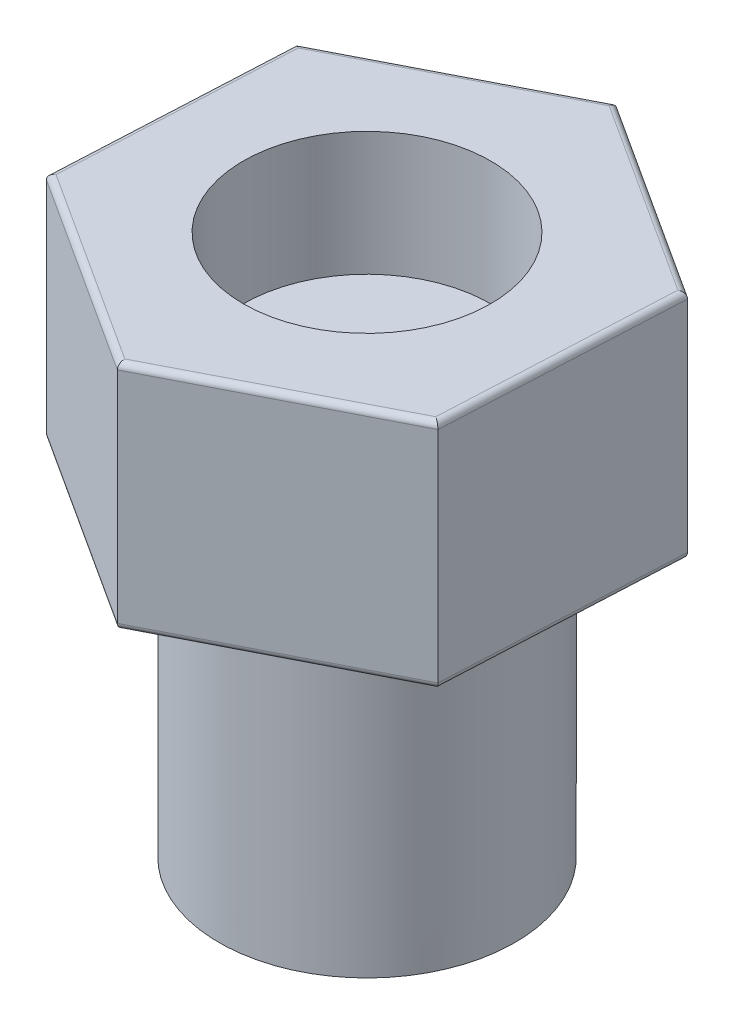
ISO-10303-21;
HEADER;
FILE_DESCRIPTION(('STEP AP214'),'2;1');
FILE_NAME('part.step','',(''),(''),'','','');
FILE_SCHEMA(('AUTOMOTIVE_DESIGN { 1 0 10303 214 1 1 1 1 }'));
ENDSEC;
DATA;
#1=APPLICATION_CONTEXT('core data for automotive mechanical design processes');
#2=APPLICATION_PROTOCOL_DEFINITION('international standard','automotive_design',2000,#1);
#3=PRODUCT_CONTEXT('',#1,'mechanical');
#4=PRODUCT('Part','Part','',(#3));
#5=PRODUCT_RELATED_PRODUCT_CATEGORY('part','',(#4));
#6=PRODUCT_DEFINITION_FORMATION('','',#4);
#7=PRODUCT_DEFINITION_CONTEXT('part definition',#1,'design');
#8=PRODUCT_DEFINITION('design','',#6,#7);
#9=PRODUCT_DEFINITION_SHAPE('','',#8);
#10=(LENGTH_UNIT() NAMED_UNIT(*) SI_UNIT(.MILLI.,.METRE.));
#11=(NAMED_UNIT(*) PLANE_ANGLE_UNIT() SI_UNIT($,.RADIAN.));
#12=(NAMED_UNIT(*) SI_UNIT($,.STERADIAN.) SOLID_ANGLE_UNIT());
#13=UNCERTAINTY_MEASURE_WITH_UNIT(LENGTH_MEASURE(1.E-05),#10,'distance_accuracy_value','');
#14=(GEOMETRIC_REPRESENTATION_CONTEXT(3) GLOBAL_UNCERTAINTY_ASSIGNED_CONTEXT((#13)) GLOBAL_UNIT_ASSIGNED_CONTEXT((#10,
#11,#12)) REPRESENTATION_CONTEXT('',''));
#15=CARTESIAN_POINT('',(0.,0.,0.));
#16=DIRECTION('',(0.,0.,1.));
#17=DIRECTION('',(1.,0.,0.));
#18=AXIS2_PLACEMENT_3D('',#15,#16,#17);
#19=CARTESIAN_POINT('',(12.320714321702,-2.22044604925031E-13,7.95319633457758));
#20=DIRECTION('',(0.,1.,0.));
#21=DIRECTION('',(0.,0.,1.));
#22=AXIS2_PLACEMENT_3D('',#19,#20,#21);
#23=PLANE('',#22);
#24=DIRECTION('',(-0.840161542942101,0.,-0.542336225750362));
#25=VECTOR('',#24,1.);
#26=CARTESIAN_POINT('',(19.0017542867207,-2.22044604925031E-13,-2.39675371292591));
#27=LINE('',#26,#25);
#28=CARTESIAN_POINT('',(0.705493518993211,-1.11022302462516E-13,-14.2072502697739));
#29=VERTEX_POINT('',#28);
#30=CARTESIAN_POINT('',(12.6565864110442,-1.11022302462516E-13,-6.49264982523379));
#31=VERTEX_POINT('',#30);
#32=EDGE_CURVE('E179',#29,#31,#27,.F.);
#33=ORIENTED_EDGE('',*,*,#32,.T.);
#34=DIRECTION('',(0.0495961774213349,0.,-0.998769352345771));
#35=VECTOR('',#34,1.);
#36=CARTESIAN_POINT('',(11.9401831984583,0.,7.93430019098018));
#37=LINE('',#36,#35);
#38=CARTESIAN_POINT('',(11.9510928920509,0.,7.71460044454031));
#39=VERTEX_POINT('',#38);
#40=EDGE_CURVE('E140',#31,#39,#37,.F.);
#41=ORIENTED_EDGE('',*,*,#40,.T.);
#42=DIRECTION('',(0.889757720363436,0.,-0.456433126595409));
#43=VECTOR('',#42,1.);
#44=CARTESIAN_POINT('',(12.1468133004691,1.11022302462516E-13,7.61419864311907));
#45=LINE('',#44,#43);
#46=CARTESIAN_POINT('',(-0.705493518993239,1.11022302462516E-13,14.2072502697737));
#47=VERTEX_POINT('',#46);
#48=EDGE_CURVE('E168',#39,#47,#45,.F.);
#49=ORIENTED_EDGE('',*,*,#48,.T.);
#50=DIRECTION('',(0.840161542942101,0.,0.542336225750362));
#51=VECTOR('',#50,1.);
#52=CARTESIAN_POINT('',(5.63967435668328,0.,18.3031463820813));
#53=LINE('',#52,#51);
#54=CARTESIAN_POINT('',(-12.6565864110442,1.11022302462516E-13,6.49264982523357));
#55=VERTEX_POINT('',#54);
#56=EDGE_CURVE('E173',#47,#55,#53,.F.);
#57=ORIENTED_EDGE('',*,*,#56,.T.);
#58=DIRECTION('',(-0.0495961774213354,0.,0.998769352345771));
#59=VECTOR('',#58,1.);
#60=CARTESIAN_POINT('',(-12.6674961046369,0.,6.71234957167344));
#61=LINE('',#60,#59);
#62=CARTESIAN_POINT('',(-11.951092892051,0.,-7.71460044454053));
#63=VERTEX_POINT('',#62);
#64=EDGE_CURVE('E175',#55,#63,#61,.F.);
#65=ORIENTED_EDGE('',*,*,#64,.T.);
#66=DIRECTION('',(-0.889757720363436,0.,0.45643312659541));
#67=VECTOR('',#66,1.);
#68=CARTESIAN_POINT('',(0.901213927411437,0.,-14.3076520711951));
#69=LINE('',#68,#67);
#70=EDGE_CURVE('E177',#63,#29,#69,.F.);
#71=ORIENTED_EDGE('',*,*,#70,.T.);
#72=EDGE_LOOP('',(#33,#41,#49,#57,#65,#71));
#73=FACE_BOUND('',#72,.T.);
#74=CARTESIAN_POINT('',(0.,0.,0.));
#75=DIRECTION('',(0.,1.,0.));
#76=DIRECTION('',(0.,0.,1.));
#77=AXIS2_PLACEMENT_3D('',#74,#75,#76);
#78=CIRCLE('',#77,9.1186);
#79=CARTESIAN_POINT('',(0.,0.,9.1186));
#80=VERTEX_POINT('',#79);
#81=EDGE_CURVE('E11',#80,#80,#78,.F.);
#82=ORIENTED_EDGE('',*,*,#81,.F.);
#83=EDGE_LOOP('',(#82));
#84=FACE_BOUND('',#83,.T.);
#85=ADVANCED_FACE('F39',(#73,#84),#23,.F.);
#86=CARTESIAN_POINT('',(-0.727312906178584,14.2747999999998,14.6466497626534));
#87=DIRECTION('',(-0.456433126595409,0.,-0.889757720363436));
#88=DIRECTION('',(-0.889757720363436,0.,0.456433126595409));
#89=AXIS2_PLACEMENT_3D('',#86,#87,#88);
#90=PLANE('',#89);
#91=DIRECTION('',(0.,-1.,0.));
#92=VECTOR('',#91,1.);
#93=CARTESIAN_POINT('',(-0.727312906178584,14.2747999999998,14.6466497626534));
#94=LINE('',#93,#92);
#95=CARTESIAN_POINT('',(-0.727312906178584,13.8938,14.6466497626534));
#96=VERTEX_POINT('',#95);
#97=CARTESIAN_POINT('',(-0.727312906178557,0.381000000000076,14.6466497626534));
#98=VERTEX_POINT('',#97);
#99=EDGE_CURVE('E225',#96,#98,#94,.T.);
#100=ORIENTED_EDGE('',*,*,#99,.T.);
#101=DIRECTION('',(0.889757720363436,0.,-0.456433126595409));
#102=VECTOR('',#101,1.);
#103=CARTESIAN_POINT('',(-0.727312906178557,0.381000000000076,14.6466497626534));
#104=LINE('',#103,#102);
#105=CARTESIAN_POINT('',(12.320714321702,0.381000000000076,7.95319633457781));
#106=VERTEX_POINT('',#105);
#107=EDGE_CURVE('E199',#98,#106,#104,.T.);
#108=ORIENTED_EDGE('',*,*,#107,.T.);
#109=DIRECTION('',(0.,-1.,0.));
#110=VECTOR('',#109,1.);
#111=CARTESIAN_POINT('',(12.320714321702,14.2747999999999,7.95319633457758));
#112=LINE('',#111,#110);
#113=CARTESIAN_POINT('',(12.320714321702,13.8938,7.95319633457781));
#114=VERTEX_POINT('',#113);
#115=EDGE_CURVE('E151',#114,#106,#112,.T.);
#116=ORIENTED_EDGE('',*,*,#115,.F.);
#117=DIRECTION('',(0.889757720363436,0.,-0.456433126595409));
#118=VECTOR('',#117,1.);
#119=CARTESIAN_POINT('',(-0.727312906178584,13.8938,14.6466497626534));
#120=LINE('',#119,#118);
#121=EDGE_CURVE('E197',#114,#96,#120,.F.);
#122=ORIENTED_EDGE('',*,*,#121,.T.);
#123=EDGE_LOOP('',(#100,#108,#116,#122));
#124=FACE_BOUND('',#123,.T.);
#125=ADVANCED_FACE('F251',(#124),#90,.F.);
#126=CARTESIAN_POINT('',(12.320714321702,14.2747999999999,7.95319633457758));
#127=DIRECTION('',(-0.998769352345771,0.,-0.0495961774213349));
#128=DIRECTION('',(-0.0495961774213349,0.,0.998769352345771));
#129=AXIS2_PLACEMENT_3D('',#126,#127,#128);
#130=PLANE('',#129);
#131=ORIENTED_EDGE('',*,*,#115,.T.);
#132=DIRECTION('',(0.0495961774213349,0.,-0.998769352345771));
#133=VECTOR('',#132,1.);
#134=CARTESIAN_POINT('',(12.320714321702,0.381000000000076,7.95319633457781));
#135=LINE('',#134,#133);
#136=CARTESIAN_POINT('',(13.0480272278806,0.380999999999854,-6.69345342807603));
#137=VERTEX_POINT('',#136);
#138=EDGE_CURVE('E150',#106,#137,#135,.T.);
#139=ORIENTED_EDGE('',*,*,#138,.T.);
#140=DIRECTION('',(0.,-1.,0.));
#141=VECTOR('',#140,1.);
#142=CARTESIAN_POINT('',(13.0480272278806,14.2748,-6.69345342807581));
#143=LINE('',#142,#141);
#144=CARTESIAN_POINT('',(13.0480272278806,13.8938,-6.69345342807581));
#145=VERTEX_POINT('',#144);
#146=EDGE_CURVE('E132',#145,#137,#143,.T.);
#147=ORIENTED_EDGE('',*,*,#146,.F.);
#148=DIRECTION('',(0.0495961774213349,0.,-0.998769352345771));
#149=VECTOR('',#148,1.);
#150=CARTESIAN_POINT('',(12.320714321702,13.8938,7.95319633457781));
#151=LINE('',#150,#149);
#152=EDGE_CURVE('E147',#145,#114,#151,.F.);
#153=ORIENTED_EDGE('',*,*,#152,.T.);
#154=EDGE_LOOP('',(#131,#139,#147,#153));
#155=FACE_BOUND('',#154,.T.);
#156=ADVANCED_FACE('F145',(#155),#130,.F.);
#157=CARTESIAN_POINT('',(13.0480272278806,14.2748,-6.69345342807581));
#158=DIRECTION('',(-0.542336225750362,0.,0.840161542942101));
#159=DIRECTION('',(0.840161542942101,0.,0.542336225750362));
#160=AXIS2_PLACEMENT_3D('',#157,#158,#159);
#161=PLANE('',#160);
#162=ORIENTED_EDGE('',*,*,#146,.T.);
#163=DIRECTION('',(-0.840161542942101,0.,-0.542336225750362));
#164=VECTOR('',#163,1.);
#165=CARTESIAN_POINT('',(13.0480272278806,0.380999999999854,-6.69345342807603));
#166=LINE('',#165,#164);
#167=CARTESIAN_POINT('',(0.727312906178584,0.381000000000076,-14.6466497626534));
#168=VERTEX_POINT('',#167);
#169=EDGE_CURVE('E139',#137,#168,#166,.T.);
#170=ORIENTED_EDGE('',*,*,#169,.T.);
#171=DIRECTION('',(0.,-1.,0.));
#172=VECTOR('',#171,1.);
#173=CARTESIAN_POINT('',(0.727312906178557,14.2747999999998,-14.6466497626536));
#174=LINE('',#173,#172);
#175=CARTESIAN_POINT('',(0.727312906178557,13.8938,-14.6466497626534));
#176=VERTEX_POINT('',#175);
#177=EDGE_CURVE('E134',#176,#168,#174,.T.);
#178=ORIENTED_EDGE('',*,*,#177,.F.);
#179=DIRECTION('',(-0.840161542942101,0.,-0.542336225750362));
#180=VECTOR('',#179,1.);
#181=CARTESIAN_POINT('',(13.0480272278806,13.8938,-6.69345342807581));
#182=LINE('',#181,#180);
#183=EDGE_CURVE('E129',#176,#145,#182,.F.);
#184=ORIENTED_EDGE('',*,*,#183,.T.);
#185=EDGE_LOOP('',(#162,#170,#178,#184));
#186=FACE_BOUND('',#185,.T.);
#187=ADVANCED_FACE('F131',(#186),#161,.F.);
#188=CARTESIAN_POINT('',(0.727312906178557,14.2747999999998,-14.6466497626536));
#189=DIRECTION('',(0.45643312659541,0.,0.889757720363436));
#190=DIRECTION('',(0.889757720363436,0.,-0.45643312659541));
#191=AXIS2_PLACEMENT_3D('',#188,#189,#190);
#192=PLANE('',#191);
#193=ORIENTED_EDGE('',*,*,#177,.T.);
#194=DIRECTION('',(-0.889757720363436,0.,0.45643312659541));
#195=VECTOR('',#194,1.);
#196=CARTESIAN_POINT('',(0.727312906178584,0.381000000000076,-14.6466497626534));
#197=LINE('',#196,#195);
#198=CARTESIAN_POINT('',(-12.320714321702,0.381000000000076,-7.95319633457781));
#199=VERTEX_POINT('',#198);
#200=EDGE_CURVE('E186',#168,#199,#197,.T.);
#201=ORIENTED_EDGE('',*,*,#200,.T.);
#202=DIRECTION('',(0.,-1.,0.));
#203=VECTOR('',#202,1.);
#204=CARTESIAN_POINT('',(-12.320714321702,14.2747999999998,-7.95319633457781));
#205=LINE('',#204,#203);
#206=CARTESIAN_POINT('',(-12.320714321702,13.8938,-7.95319633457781));
#207=VERTEX_POINT('',#206);
#208=EDGE_CURVE('E260',#207,#199,#205,.T.);
#209=ORIENTED_EDGE('',*,*,#208,.F.);
#210=DIRECTION('',(-0.889757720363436,0.,0.45643312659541));
#211=VECTOR('',#210,1.);
#212=CARTESIAN_POINT('',(0.727312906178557,13.8938,-14.6466497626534));
#213=LINE('',#212,#211);
#214=EDGE_CURVE('E184',#207,#176,#213,.F.);
#215=ORIENTED_EDGE('',*,*,#214,.T.);
#216=EDGE_LOOP('',(#193,#201,#209,#215));
#217=FACE_BOUND('',#216,.T.);
#218=ADVANCED_FACE('F269',(#217),#192,.F.);
#219=CARTESIAN_POINT('',(-12.320714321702,14.2747999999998,-7.95319633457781));
#220=DIRECTION('',(0.998769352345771,0.,0.0495961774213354));
#221=DIRECTION('',(0.0495961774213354,0.,-0.998769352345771));
#222=AXIS2_PLACEMENT_3D('',#219,#220,#221);
#223=PLANE('',#222);
#224=ORIENTED_EDGE('',*,*,#208,.T.);
#225=DIRECTION('',(-0.0495961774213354,0.,0.998769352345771));
#226=VECTOR('',#225,1.);
#227=CARTESIAN_POINT('',(-12.320714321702,0.381000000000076,-7.95319633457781));
#228=LINE('',#227,#226);
#229=CARTESIAN_POINT('',(-13.0480272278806,0.380999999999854,6.69345342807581));
#230=VERTEX_POINT('',#229);
#231=EDGE_CURVE('E190',#199,#230,#228,.T.);
#232=ORIENTED_EDGE('',*,*,#231,.T.);
#233=DIRECTION('',(0.,-1.,0.));
#234=VECTOR('',#233,1.);
#235=CARTESIAN_POINT('',(-13.0480272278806,14.2748,6.69345342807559));
#236=LINE('',#235,#234);
#237=CARTESIAN_POINT('',(-13.0480272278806,13.8938,6.69345342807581));
#238=VERTEX_POINT('',#237);
#239=EDGE_CURVE('E258',#238,#230,#236,.T.);
#240=ORIENTED_EDGE('',*,*,#239,.F.);
#241=DIRECTION('',(-0.0495961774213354,0.,0.998769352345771));
#242=VECTOR('',#241,1.);
#243=CARTESIAN_POINT('',(-12.320714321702,13.8938,-7.95319633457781));
#244=LINE('',#243,#242);
#245=EDGE_CURVE('E188',#238,#207,#244,.F.);
#246=ORIENTED_EDGE('',*,*,#245,.T.);
#247=EDGE_LOOP('',(#224,#232,#240,#246));
#248=FACE_BOUND('',#247,.T.);
#249=ADVANCED_FACE('F300',(#248),#223,.F.);
#250=CARTESIAN_POINT('',(-13.0480272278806,14.2748,6.69345342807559));
#251=DIRECTION('',(0.542336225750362,0.,-0.840161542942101));
#252=DIRECTION('',(-0.840161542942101,0.,-0.542336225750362));
#253=AXIS2_PLACEMENT_3D('',#250,#251,#252);
#254=PLANE('',#253);
#255=ORIENTED_EDGE('',*,*,#239,.T.);
#256=DIRECTION('',(0.840161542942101,0.,0.542336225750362));
#257=VECTOR('',#256,1.);
#258=CARTESIAN_POINT('',(-13.0480272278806,0.380999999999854,6.69345342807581));
#259=LINE('',#258,#257);
#260=EDGE_CURVE('E195',#230,#98,#259,.T.);
#261=ORIENTED_EDGE('',*,*,#260,.T.);
#262=ORIENTED_EDGE('',*,*,#99,.F.);
#263=DIRECTION('',(0.840161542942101,0.,0.542336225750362));
#264=VECTOR('',#263,1.);
#265=CARTESIAN_POINT('',(-13.0480272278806,13.8938,6.69345342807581));
#266=LINE('',#265,#264);
#267=EDGE_CURVE('E192',#96,#238,#266,.F.);
#268=ORIENTED_EDGE('',*,*,#267,.T.);
#269=EDGE_LOOP('',(#255,#261,#262,#268));
#270=FACE_BOUND('',#269,.T.);
#271=ADVANCED_FACE('F255',(#270),#254,.F.);
#272=CARTESIAN_POINT('',(12.320714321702,14.2747999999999,7.95319633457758));
#273=DIRECTION('',(0.,1.,0.));
#274=DIRECTION('',(0.,0.,1.));
#275=AXIS2_PLACEMENT_3D('',#272,#273,#274);
#276=PLANE('',#275);
#277=CARTESIAN_POINT('',(0.,14.2748,-2.22044604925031E-13));
#278=DIRECTION('',(0.,1.,0.));
#279=DIRECTION('',(0.,0.,1.));
#280=AXIS2_PLACEMENT_3D('',#277,#278,#279);
#281=CIRCLE('',#280,7.62);
#282=CARTESIAN_POINT('',(0.,14.2748,7.62));
#283=VERTEX_POINT('',#282);
#284=EDGE_CURVE('E348',#283,#283,#281,.T.);
#285=ORIENTED_EDGE('',*,*,#284,.F.);
#286=EDGE_LOOP('',(#285));
#287=FACE_BOUND('',#286,.T.);
#288=DIRECTION('',(-0.0495961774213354,0.,0.998769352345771));
#289=VECTOR('',#288,1.);
#290=CARTESIAN_POINT('',(-12.6674961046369,14.2747999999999,6.71234957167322));
#291=LINE('',#290,#289);
#292=CARTESIAN_POINT('',(-11.9510928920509,14.2748,-7.71460044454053));
#293=VERTEX_POINT('',#292);
#294=CARTESIAN_POINT('',(-12.6565864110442,14.2748000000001,6.49264982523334));
#295=VERTEX_POINT('',#294);
#296=EDGE_CURVE('E54',#293,#295,#291,.T.);
#297=ORIENTED_EDGE('',*,*,#296,.T.);
#298=DIRECTION('',(0.840161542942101,0.,0.542336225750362));
#299=VECTOR('',#298,1.);
#300=CARTESIAN_POINT('',(-0.520682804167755,14.2747999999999,14.3265482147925));
#301=LINE('',#300,#299);
#302=CARTESIAN_POINT('',(-0.705493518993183,14.2747999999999,14.2072502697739));
#303=VERTEX_POINT('',#302);
#304=EDGE_CURVE('E47',#295,#303,#301,.T.);
#305=ORIENTED_EDGE('',*,*,#304,.T.);
#306=DIRECTION('',(0.889757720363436,0.,-0.456433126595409));
#307=VECTOR('',#306,1.);
#308=CARTESIAN_POINT('',(12.1468133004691,14.2748000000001,7.61419864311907));
#309=LINE('',#308,#307);
#310=CARTESIAN_POINT('',(11.9510928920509,14.2748,7.71460044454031));
#311=VERTEX_POINT('',#310);
#312=EDGE_CURVE('E201',#303,#311,#309,.T.);
#313=ORIENTED_EDGE('',*,*,#312,.T.);
#314=DIRECTION('',(0.0495961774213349,0.,-0.998769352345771));
#315=VECTOR('',#314,1.);
#316=CARTESIAN_POINT('',(12.6674961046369,14.2747999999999,-6.71234957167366));
#317=LINE('',#316,#315);
#318=CARTESIAN_POINT('',(12.6565864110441,14.2747999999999,-6.49264982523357));
#319=VERTEX_POINT('',#318);
#320=EDGE_CURVE('E203',#311,#319,#317,.T.);
#321=ORIENTED_EDGE('',*,*,#320,.T.);
#322=DIRECTION('',(-0.840161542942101,0.,-0.542336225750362));
#323=VECTOR('',#322,1.);
#324=CARTESIAN_POINT('',(0.520682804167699,14.2747999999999,-14.3265482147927));
#325=LINE('',#324,#323);
#326=CARTESIAN_POINT('',(0.705493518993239,14.2747999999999,-14.2072502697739));
#327=VERTEX_POINT('',#326);
#328=EDGE_CURVE('E156',#319,#327,#325,.T.);
#329=ORIENTED_EDGE('',*,*,#328,.T.);
#330=DIRECTION('',(-0.889757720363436,0.,0.45643312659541));
#331=VECTOR('',#330,1.);
#332=CARTESIAN_POINT('',(-12.1468133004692,14.2747999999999,-7.6141986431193));
#333=LINE('',#332,#331);
#334=EDGE_CURVE('E59',#327,#293,#333,.T.);
#335=ORIENTED_EDGE('',*,*,#334,.T.);
#336=EDGE_LOOP('',(#297,#305,#313,#321,#329,#335));
#337=FACE_BOUND('',#336,.T.);
#338=ADVANCED_FACE('F245',(#287,#337),#276,.T.);
#339=CARTESIAN_POINT('',(-11.9401831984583,0.381000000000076,-7.9343001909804));
#340=DIRECTION('',(-0.0495961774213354,0.,0.998769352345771));
#341=DIRECTION('',(0.998769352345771,0.,0.0495961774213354));
#342=AXIS2_PLACEMENT_3D('',#339,#340,#341);
#343=CYLINDRICAL_SURFACE('',#342,0.381);
#344=CARTESIAN_POINT('',(-11.951092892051,0.380999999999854,-7.71460044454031));
#345=DIRECTION('',(-0.542336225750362,0.,0.840161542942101));
#346=DIRECTION('',(0.840161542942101,0.,0.542336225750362));
#347=AXIS2_PLACEMENT_3D('',#344,#345,#346);
#348=ELLIPSE('',#347,0.439940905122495,0.381);
#349=EDGE_CURVE('E219',#63,#199,#348,.F.);
#350=ORIENTED_EDGE('',*,*,#349,.F.);
#351=ORIENTED_EDGE('',*,*,#64,.F.);
#352=CARTESIAN_POINT('',(-12.6565864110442,0.380999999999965,6.49264982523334));
#353=DIRECTION('',(0.456433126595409,0.,0.889757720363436));
#354=DIRECTION('',(0.889757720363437,0.,-0.456433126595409));
#355=AXIS2_PLACEMENT_3D('',#352,#353,#354);
#356=ELLIPSE('',#355,0.439940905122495,0.381);
#357=EDGE_CURVE('E222',#230,#55,#356,.T.);
#358=ORIENTED_EDGE('',*,*,#357,.F.);
#359=ORIENTED_EDGE('',*,*,#231,.F.);
#360=EDGE_LOOP('',(#350,#351,#358,#359));
#361=FACE_BOUND('',#360,.T.);
#362=ADVANCED_FACE('F298',(#361),#343,.T.);
#363=CARTESIAN_POINT('',(-12.8413971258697,0.380999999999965,6.37335188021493));
#364=DIRECTION('',(0.840161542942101,0.,0.542336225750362));
#365=DIRECTION('',(0.542336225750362,0.,-0.840161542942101));
#366=AXIS2_PLACEMENT_3D('',#363,#364,#365);
#367=CYLINDRICAL_SURFACE('',#366,0.381);
#368=ORIENTED_EDGE('',*,*,#357,.T.);
#369=ORIENTED_EDGE('',*,*,#56,.F.);
#370=CARTESIAN_POINT('',(-0.705493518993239,0.380999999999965,14.2072502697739));
#371=DIRECTION('',(0.998769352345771,0.,0.0495961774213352));
#372=DIRECTION('',(0.049596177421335,0.,-0.998769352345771));
#373=AXIS2_PLACEMENT_3D('',#370,#371,#372);
#374=ELLIPSE('',#373,0.439940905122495,0.381);
#375=EDGE_CURVE('E216',#98,#47,#374,.T.);
#376=ORIENTED_EDGE('',*,*,#375,.F.);
#377=ORIENTED_EDGE('',*,*,#260,.F.);
#378=EDGE_LOOP('',(#368,#369,#376,#377));
#379=FACE_BOUND('',#378,.T.);
#380=ADVANCED_FACE('F294',(#379),#367,.T.);
#381=CARTESIAN_POINT('',(0.901213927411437,0.380999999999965,-14.3076520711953));
#382=DIRECTION('',(-0.889757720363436,0.,0.45643312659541));
#383=DIRECTION('',(0.45643312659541,0.,0.889757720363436));
#384=AXIS2_PLACEMENT_3D('',#381,#382,#383);
#385=CYLINDRICAL_SURFACE('',#384,0.381);
#386=ORIENTED_EDGE('',*,*,#349,.T.);
#387=ORIENTED_EDGE('',*,*,#200,.F.);
#388=CARTESIAN_POINT('',(0.705493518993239,0.380999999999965,-14.2072502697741));
#389=DIRECTION('',(-0.998769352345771,0.,-0.0495961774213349));
#390=DIRECTION('',(-0.0495961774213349,0.,0.998769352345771));
#391=AXIS2_PLACEMENT_3D('',#388,#389,#390);
#392=ELLIPSE('',#391,0.439940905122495,0.381);
#393=EDGE_CURVE('E213',#29,#168,#392,.F.);
#394=ORIENTED_EDGE('',*,*,#393,.F.);
#395=ORIENTED_EDGE('',*,*,#70,.F.);
#396=EDGE_LOOP('',(#386,#387,#394,#395));
#397=FACE_BOUND('',#396,.T.);
#398=ADVANCED_FACE('F273',(#397),#385,.T.);
#399=CARTESIAN_POINT('',(-0.901213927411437,0.380999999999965,14.3076520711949));
#400=DIRECTION('',(0.889757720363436,0.,-0.456433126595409));
#401=DIRECTION('',(-0.456433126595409,0.,-0.889757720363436));
#402=AXIS2_PLACEMENT_3D('',#399,#400,#401);
#403=CYLINDRICAL_SURFACE('',#402,0.381);
#404=ORIENTED_EDGE('',*,*,#375,.T.);
#405=ORIENTED_EDGE('',*,*,#48,.F.);
#406=CARTESIAN_POINT('',(11.9510928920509,0.380999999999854,7.71460044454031));
#407=DIRECTION('',(0.542336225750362,0.,-0.840161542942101));
#408=DIRECTION('',(0.840161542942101,0.,0.542336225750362));
#409=AXIS2_PLACEMENT_3D('',#406,#407,#408);
#410=ELLIPSE('',#409,0.439940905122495,0.381);
#411=EDGE_CURVE('E211',#106,#39,#410,.T.);
#412=ORIENTED_EDGE('',*,*,#411,.F.);
#413=ORIENTED_EDGE('',*,*,#107,.F.);
#414=EDGE_LOOP('',(#404,#405,#412,#413));
#415=FACE_BOUND('',#414,.T.);
#416=ADVANCED_FACE('F290',(#415),#403,.T.);
#417=CARTESIAN_POINT('',(12.8413971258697,0.380999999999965,-6.37335188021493));
#418=DIRECTION('',(-0.840161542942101,0.,-0.542336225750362));
#419=DIRECTION('',(-0.542336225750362,0.,0.840161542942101));
#420=AXIS2_PLACEMENT_3D('',#417,#418,#419);
#421=CYLINDRICAL_SURFACE('',#420,0.381);
#422=ORIENTED_EDGE('',*,*,#393,.T.);
#423=ORIENTED_EDGE('',*,*,#169,.F.);
#424=CARTESIAN_POINT('',(12.6565864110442,0.380999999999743,-6.49264982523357));
#425=DIRECTION('',(-0.456433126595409,0.,-0.889757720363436));
#426=DIRECTION('',(-0.889757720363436,0.,0.45643312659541));
#427=AXIS2_PLACEMENT_3D('',#424,#425,#426);
#428=ELLIPSE('',#427,0.439940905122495,0.381);
#429=EDGE_CURVE('E209',#31,#137,#428,.F.);
#430=ORIENTED_EDGE('',*,*,#429,.F.);
#431=ORIENTED_EDGE('',*,*,#32,.F.);
#432=EDGE_LOOP('',(#422,#423,#430,#431));
#433=FACE_BOUND('',#432,.T.);
#434=ADVANCED_FACE('F279',(#433),#421,.T.);
#435=CARTESIAN_POINT('',(11.9401831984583,0.381000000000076,7.93430019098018));
#436=DIRECTION('',(0.0495961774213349,0.,-0.998769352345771));
#437=DIRECTION('',(-0.998769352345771,0.,-0.0495961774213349));
#438=AXIS2_PLACEMENT_3D('',#435,#436,#437);
#439=CYLINDRICAL_SURFACE('',#438,0.381);
#440=ORIENTED_EDGE('',*,*,#411,.T.);
#441=ORIENTED_EDGE('',*,*,#40,.F.);
#442=ORIENTED_EDGE('',*,*,#429,.T.);
#443=ORIENTED_EDGE('',*,*,#138,.F.);
#444=EDGE_LOOP('',(#440,#441,#442,#443));
#445=FACE_BOUND('',#444,.T.);
#446=ADVANCED_FACE('F285',(#445),#439,.T.);
#447=CARTESIAN_POINT('',(19.0017542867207,13.8938,-2.39675371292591));
#448=DIRECTION('',(0.840161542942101,0.,0.542336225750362));
#449=DIRECTION('',(0.542336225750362,0.,-0.840161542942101));
#450=AXIS2_PLACEMENT_3D('',#447,#448,#449);
#451=CYLINDRICAL_SURFACE('',#450,0.381);
#452=CARTESIAN_POINT('',(12.6565864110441,13.8937999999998,-6.49264982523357));
#453=DIRECTION('',(0.456433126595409,0.,0.889757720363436));
#454=DIRECTION('',(-0.889757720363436,0.,0.45643312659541));
#455=AXIS2_PLACEMENT_3D('',#452,#453,#454);
#456=ELLIPSE('',#455,0.439940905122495,0.381);
#457=EDGE_CURVE('E155',#145,#319,#456,.T.);
#458=ORIENTED_EDGE('',*,*,#457,.F.);
#459=ORIENTED_EDGE('',*,*,#183,.F.);
#460=CARTESIAN_POINT('',(0.705493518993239,13.8937999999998,-14.2072502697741));
#461=DIRECTION('',(0.998769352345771,0.,0.0495961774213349));
#462=DIRECTION('',(-0.0495961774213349,0.,0.998769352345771));
#463=AXIS2_PLACEMENT_3D('',#460,#461,#462);
#464=ELLIPSE('',#463,0.439940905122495,0.381);
#465=EDGE_CURVE('E159',#327,#176,#464,.F.);
#466=ORIENTED_EDGE('',*,*,#465,.F.);
#467=ORIENTED_EDGE('',*,*,#328,.F.);
#468=EDGE_LOOP('',(#458,#459,#466,#467));
#469=FACE_BOUND('',#468,.T.);
#470=ADVANCED_FACE('F41',(#469),#451,.T.);
#471=CARTESIAN_POINT('',(0.901213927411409,13.8938,-14.3076520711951));
#472=DIRECTION('',(0.889757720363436,0.,-0.45643312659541));
#473=DIRECTION('',(-0.45643312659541,0.,-0.889757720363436));
#474=AXIS2_PLACEMENT_3D('',#471,#472,#473);
#475=CYLINDRICAL_SURFACE('',#474,0.381);
#476=ORIENTED_EDGE('',*,*,#465,.T.);
#477=ORIENTED_EDGE('',*,*,#214,.F.);
#478=CARTESIAN_POINT('',(-11.9510928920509,13.8938,-7.71460044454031));
#479=DIRECTION('',(0.542336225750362,0.,-0.840161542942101));
#480=DIRECTION('',(0.840161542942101,0.,0.542336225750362));
#481=AXIS2_PLACEMENT_3D('',#478,#479,#480);
#482=ELLIPSE('',#481,0.439940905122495,0.381);
#483=EDGE_CURVE('E160',#293,#207,#482,.F.);
#484=ORIENTED_EDGE('',*,*,#483,.F.);
#485=ORIENTED_EDGE('',*,*,#334,.F.);
#486=EDGE_LOOP('',(#476,#477,#484,#485));
#487=FACE_BOUND('',#486,.T.);
#488=ADVANCED_FACE('F235',(#487),#475,.T.);
#489=CARTESIAN_POINT('',(11.9401831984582,13.8938,7.93430019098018));
#490=DIRECTION('',(-0.0495961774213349,0.,0.998769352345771));
#491=DIRECTION('',(0.998769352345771,0.,0.0495961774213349));
#492=AXIS2_PLACEMENT_3D('',#489,#490,#491);
#493=CYLINDRICAL_SURFACE('',#492,0.381);
#494=ORIENTED_EDGE('',*,*,#457,.T.);
#495=ORIENTED_EDGE('',*,*,#320,.F.);
#496=CARTESIAN_POINT('',(11.9510928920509,13.8937999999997,7.71460044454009));
#497=DIRECTION('',(-0.542336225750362,0.,0.840161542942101));
#498=DIRECTION('',(-0.840161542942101,0.,-0.542336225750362));
#499=AXIS2_PLACEMENT_3D('',#496,#497,#498);
#500=ELLIPSE('',#499,0.439940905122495,0.381);
#501=EDGE_CURVE('E165',#114,#311,#500,.T.);
#502=ORIENTED_EDGE('',*,*,#501,.F.);
#503=ORIENTED_EDGE('',*,*,#152,.F.);
#504=EDGE_LOOP('',(#494,#495,#502,#503));
#505=FACE_BOUND('',#504,.T.);
#506=ADVANCED_FACE('F163',(#505),#493,.T.);
#507=CARTESIAN_POINT('',(-12.6674961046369,13.8937999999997,6.71234957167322));
#508=DIRECTION('',(0.0495961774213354,0.,-0.998769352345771));
#509=DIRECTION('',(-0.998769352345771,0.,-0.0495961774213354));
#510=AXIS2_PLACEMENT_3D('',#507,#508,#509);
#511=CYLINDRICAL_SURFACE('',#510,0.381);
#512=ORIENTED_EDGE('',*,*,#483,.T.);
#513=ORIENTED_EDGE('',*,*,#245,.F.);
#514=CARTESIAN_POINT('',(-12.6565864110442,13.8937999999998,6.49264982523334));
#515=DIRECTION('',(-0.456433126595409,0.,-0.889757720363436));
#516=DIRECTION('',(0.889757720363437,0.,-0.456433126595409));
#517=AXIS2_PLACEMENT_3D('',#514,#515,#516);
#518=ELLIPSE('',#517,0.439940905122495,0.381);
#519=EDGE_CURVE('E228',#295,#238,#518,.F.);
#520=ORIENTED_EDGE('',*,*,#519,.F.);
#521=ORIENTED_EDGE('',*,*,#296,.F.);
#522=EDGE_LOOP('',(#512,#513,#520,#521));
#523=FACE_BOUND('',#522,.T.);
#524=ADVANCED_FACE('F238',(#523),#511,.T.);
#525=CARTESIAN_POINT('',(12.1468133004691,13.8937999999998,7.61419864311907));
#526=DIRECTION('',(-0.889757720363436,0.,0.456433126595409));
#527=DIRECTION('',(0.456433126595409,0.,0.889757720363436));
#528=AXIS2_PLACEMENT_3D('',#525,#526,#527);
#529=CYLINDRICAL_SURFACE('',#528,0.381);
#530=ORIENTED_EDGE('',*,*,#501,.T.);
#531=ORIENTED_EDGE('',*,*,#312,.F.);
#532=CARTESIAN_POINT('',(-0.705493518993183,13.8937999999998,14.2072502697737));
#533=DIRECTION('',(-0.998769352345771,0.,-0.0495961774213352));
#534=DIRECTION('',(-0.049596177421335,0.,0.998769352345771));
#535=AXIS2_PLACEMENT_3D('',#532,#533,#534);
#536=ELLIPSE('',#535,0.439940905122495,0.381);
#537=EDGE_CURVE('E226',#96,#303,#536,.T.);
#538=ORIENTED_EDGE('',*,*,#537,.F.);
#539=ORIENTED_EDGE('',*,*,#121,.F.);
#540=EDGE_LOOP('',(#530,#531,#538,#539));
#541=FACE_BOUND('',#540,.T.);
#542=ADVANCED_FACE('F247',(#541),#529,.T.);
#543=CARTESIAN_POINT('',(5.63967435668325,13.8938,18.3031463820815));
#544=DIRECTION('',(-0.840161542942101,0.,-0.542336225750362));
#545=DIRECTION('',(-0.542336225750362,0.,0.840161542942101));
#546=AXIS2_PLACEMENT_3D('',#543,#544,#545);
#547=CYLINDRICAL_SURFACE('',#546,0.381);
#548=ORIENTED_EDGE('',*,*,#519,.T.);
#549=ORIENTED_EDGE('',*,*,#267,.F.);
#550=ORIENTED_EDGE('',*,*,#537,.T.);
#551=ORIENTED_EDGE('',*,*,#304,.F.);
#552=EDGE_LOOP('',(#548,#549,#550,#551));
#553=FACE_BOUND('',#552,.T.);
#554=ADVANCED_FACE('F242',(#553),#547,.T.);
#555=CARTESIAN_POINT('',(0.,0.,0.));
#556=DIRECTION('',(0.,1.,0.));
#557=DIRECTION('',(0.,0.,-1.));
#558=AXIS2_PLACEMENT_3D('',#555,#556,#557);
#559=CONICAL_SURFACE('',#558,9.1186,0.000349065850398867);
#560=CARTESIAN_POINT('',(0.,-19.0500000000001,-2.22044604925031E-13));
#561=DIRECTION('',(0.,-1.,0.));
#562=DIRECTION('',(0.,0.,-1.));
#563=AXIS2_PLACEMENT_3D('',#560,#561,#562);
#564=CIRCLE('',#563,9.11195029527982);
#565=CARTESIAN_POINT('',(0.,-19.0500000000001,-9.11195029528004));
#566=VERTEX_POINT('',#565);
#567=EDGE_CURVE('E229',#566,#566,#564,.T.);
#568=ORIENTED_EDGE('',*,*,#567,.F.);
#569=EDGE_LOOP('',(#568));
#570=FACE_BOUND('',#569,.T.);
#571=ORIENTED_EDGE('',*,*,#81,.T.);
#572=EDGE_LOOP('',(#571));
#573=FACE_BOUND('',#572,.T.);
#574=ADVANCED_FACE('F319',(#570,#573),#559,.T.);
#575=CARTESIAN_POINT('',(0.,-19.0500000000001,-2.22044604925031E-13));
#576=DIRECTION('',(0.,-1.,0.));
#577=DIRECTION('',(0.,0.,-1.));
#578=AXIS2_PLACEMENT_3D('',#575,#576,#577);
#579=PLANE('',#578);
#580=CARTESIAN_POINT('',(0.,-19.0500000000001,-2.22044604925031E-13));
#581=DIRECTION('',(0.,-1.,0.));
#582=DIRECTION('',(0.,0.,-1.));
#583=AXIS2_PLACEMENT_3D('',#580,#581,#582);
#584=CIRCLE('',#583,6.35);
#585=CARTESIAN_POINT('',(0.,-19.0500000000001,-6.35000000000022));
#586=VERTEX_POINT('',#585);
#587=EDGE_CURVE('E347',#586,#586,#584,.T.);
#588=ORIENTED_EDGE('',*,*,#587,.F.);
#589=EDGE_LOOP('',(#588));
#590=FACE_BOUND('',#589,.T.);
#591=ORIENTED_EDGE('',*,*,#567,.T.);
#592=EDGE_LOOP('',(#591));
#593=FACE_BOUND('',#592,.T.);
#594=ADVANCED_FACE('F322',(#590,#593),#579,.T.);
#595=CARTESIAN_POINT('',(0.,1.26999999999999,0.));
#596=DIRECTION('',(0.,-1.,0.));
#597=DIRECTION('',(0.,0.,-1.));
#598=AXIS2_PLACEMENT_3D('',#595,#596,#597);
#599=CYLINDRICAL_SURFACE('',#598,6.35);
#600=CARTESIAN_POINT('',(0.,1.26999999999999,0.));
#601=DIRECTION('',(0.,-1.,0.));
#602=DIRECTION('',(0.,0.,-1.));
#603=AXIS2_PLACEMENT_3D('',#600,#601,#602);
#604=CIRCLE('',#603,6.35);
#605=CARTESIAN_POINT('',(0.,1.26999999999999,-6.35));
#606=VERTEX_POINT('',#605);
#607=EDGE_CURVE('E351',#606,#606,#604,.T.);
#608=ORIENTED_EDGE('',*,*,#607,.F.);
#609=EDGE_LOOP('',(#608));
#610=FACE_BOUND('',#609,.T.);
#611=ORIENTED_EDGE('',*,*,#587,.T.);
#612=EDGE_LOOP('',(#611));
#613=FACE_BOUND('',#612,.T.);
#614=ADVANCED_FACE('F326',(#610,#613),#599,.F.);
#615=CARTESIAN_POINT('',(0.,1.26999999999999,0.));
#616=DIRECTION('',(0.,-1.,0.));
#617=DIRECTION('',(0.,0.,-1.));
#618=AXIS2_PLACEMENT_3D('',#615,#616,#617);
#619=PLANE('',#618);
#620=ORIENTED_EDGE('',*,*,#607,.T.);
#621=EDGE_LOOP('',(#620));
#622=FACE_BOUND('',#621,.T.);
#623=ADVANCED_FACE('F330',(#622),#619,.T.);
#624=CARTESIAN_POINT('',(0.,6.65479999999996,0.));
#625=DIRECTION('',(0.,1.,0.));
#626=DIRECTION('',(0.,0.,1.));
#627=AXIS2_PLACEMENT_3D('',#624,#625,#626);
#628=CYLINDRICAL_SURFACE('',#627,7.62);
#629=CARTESIAN_POINT('',(0.,6.65479999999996,0.));
#630=DIRECTION('',(0.,1.,0.));
#631=DIRECTION('',(0.,0.,1.));
#632=AXIS2_PLACEMENT_3D('',#629,#630,#631);
#633=CIRCLE('',#632,7.62);
#634=CARTESIAN_POINT('',(0.,6.65479999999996,7.62));
#635=VERTEX_POINT('',#634);
#636=EDGE_CURVE('E346',#635,#635,#633,.T.);
#637=CARTESIAN_POINT('',(0.,6.65479999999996,7.62));
#638=CARTESIAN_POINT('',(0.,6.73417499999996,7.62));
#639=CARTESIAN_POINT('',(0.,6.81354999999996,7.62));
#640=CARTESIAN_POINT('',(0.,6.97229999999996,7.62));
#641=CARTESIAN_POINT('',(0.,7.05167499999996,7.62));
#642=CARTESIAN_POINT('',(0.,7.21042499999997,7.62));
#643=CARTESIAN_POINT('',(0.,7.28979999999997,7.62));
#644=CARTESIAN_POINT('',(0.,7.44854999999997,7.62));
#645=CARTESIAN_POINT('',(0.,7.52792499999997,7.62));
#646=CARTESIAN_POINT('',(0.,7.68667499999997,7.62));
#647=CARTESIAN_POINT('',(0.,7.76604999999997,7.62));
#648=CARTESIAN_POINT('',(0.,7.92479999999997,7.62));
#649=CARTESIAN_POINT('',(0.,8.00417499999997,7.62));
#650=CARTESIAN_POINT('',(0.,8.16292499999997,7.62));
#651=CARTESIAN_POINT('',(0.,8.24229999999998,7.62));
#652=CARTESIAN_POINT('',(0.,8.40104999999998,7.62));
#653=CARTESIAN_POINT('',(0.,8.48042499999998,7.62));
#654=CARTESIAN_POINT('',(0.,8.63917499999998,7.62));
#655=CARTESIAN_POINT('',(0.,8.71854999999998,7.62));
#656=CARTESIAN_POINT('',(0.,8.87729999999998,7.62));
#657=CARTESIAN_POINT('',(0.,8.95667499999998,7.62));
#658=CARTESIAN_POINT('',(0.,9.11542499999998,7.62));
#659=CARTESIAN_POINT('',(0.,9.19479999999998,7.62));
#660=CARTESIAN_POINT('',(0.,9.35354999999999,7.62));
#661=CARTESIAN_POINT('',(0.,9.43292499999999,7.62));
#662=CARTESIAN_POINT('',(0.,9.59167499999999,7.62));
#663=CARTESIAN_POINT('',(0.,9.67104999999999,7.62));
#664=CARTESIAN_POINT('',(0.,9.82979999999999,7.62));
#665=CARTESIAN_POINT('',(0.,9.90917499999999,7.62));
#666=CARTESIAN_POINT('',(0.,10.067925,7.62));
#667=CARTESIAN_POINT('',(0.,10.1473,7.62));
#668=CARTESIAN_POINT('',(0.,10.30605,7.62));
#669=CARTESIAN_POINT('',(0.,10.385425,7.62));
#670=CARTESIAN_POINT('',(0.,10.544175,7.62));
#671=CARTESIAN_POINT('',(0.,10.62355,7.62));
#672=CARTESIAN_POINT('',(0.,10.7823,7.62));
#673=CARTESIAN_POINT('',(0.,10.861675,7.62));
#674=CARTESIAN_POINT('',(0.,11.020425,7.62));
#675=CARTESIAN_POINT('',(0.,11.0998,7.62));
#676=CARTESIAN_POINT('',(0.,11.25855,7.62));
#677=CARTESIAN_POINT('',(0.,11.337925,7.62));
#678=CARTESIAN_POINT('',(0.,11.496675,7.62));
#679=CARTESIAN_POINT('',(0.,11.57605,7.62));
#680=CARTESIAN_POINT('',(0.,11.7348,7.62));
#681=CARTESIAN_POINT('',(0.,11.814175,7.62));
#682=CARTESIAN_POINT('',(0.,11.972925,7.62));
#683=CARTESIAN_POINT('',(0.,12.0523,7.62));
#684=CARTESIAN_POINT('',(0.,12.21105,7.62));
#685=CARTESIAN_POINT('',(0.,12.290425,7.62));
#686=CARTESIAN_POINT('',(0.,12.449175,7.62));
#687=CARTESIAN_POINT('',(0.,12.52855,7.62));
#688=CARTESIAN_POINT('',(0.,12.6873,7.62));
#689=CARTESIAN_POINT('',(0.,12.766675,7.62));
#690=CARTESIAN_POINT('',(0.,12.925425,7.62));
#691=CARTESIAN_POINT('',(0.,13.0048,7.62));
#692=CARTESIAN_POINT('',(0.,13.16355,7.62));
#693=CARTESIAN_POINT('',(0.,13.242925,7.62));
#694=CARTESIAN_POINT('',(0.,13.401675,7.62));
#695=CARTESIAN_POINT('',(0.,13.48105,7.62));
#696=CARTESIAN_POINT('',(0.,13.6398,7.62));
#697=CARTESIAN_POINT('',(0.,13.719175,7.62));
#698=CARTESIAN_POINT('',(0.,13.877925,7.62));
#699=CARTESIAN_POINT('',(0.,13.9573,7.62));
#700=CARTESIAN_POINT('',(0.,14.11605,7.62));
#701=CARTESIAN_POINT('',(0.,14.195425,7.62));
#702=CARTESIAN_POINT('',(0.,14.2748,7.62));
#703=B_SPLINE_CURVE_WITH_KNOTS('',3,(#637,#638,#639,#640,#641,#642,#643,#644,#645,#646,#647,
#648,#649,#650,#651,#652,#653,#654,#655,#656,#657,#658,#659,#660,#661,#662,#663,#664,#665,#666,
#667,#668,#669,#670,#671,#672,#673,#674,#675,#676,#677,#678,#679,#680,#681,#682,#683,#684,#685,
#686,#687,#688,#689,#690,#691,#692,#693,#694,#695,#696,#697,#698,#699,#700,#701,#702),
.UNSPECIFIED.,.F.,.F.,(4,2,2,2,2,2,2,2,2,2,2,2,2,2,2,2,2,2,2,2,2,2,2,2,2,2,2,2,2,2,2,2,4),(0.,
0.238125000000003,0.476250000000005,0.714375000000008,0.95250000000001,1.19062500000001,
1.42875000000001,1.66687500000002,1.90500000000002,2.14312500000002,2.38125000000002,
2.61937500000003,2.85750000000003,3.09562500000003,3.33375000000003,3.57187500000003,
3.81000000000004,4.04812500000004,4.28625000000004,4.52437500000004,4.76250000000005,
5.00062500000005,5.23875000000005,5.47687500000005,5.71500000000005,5.95312500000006,
6.19125000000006,6.42937500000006,6.66750000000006,6.90562500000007,7.14375000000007,
7.38187500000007,7.62000000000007),.UNSPECIFIED.);
#704=EDGE_CURVE('BSEAM334',#635,#283,#703,.T.);
#705=ORIENTED_EDGE('',*,*,#636,.F.);
#706=ORIENTED_EDGE('',*,*,#284,.T.);
#707=ORIENTED_EDGE('',*,*,#704,.T.);
#708=ORIENTED_EDGE('',*,*,#704,.F.);
#709=EDGE_LOOP('',(#705,#707,#706,#708));
#710=FACE_BOUND('',#709,.T.);
#711=ADVANCED_FACE('F334',(#710),#628,.F.);
#712=CARTESIAN_POINT('',(0.,6.65479999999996,0.));
#713=DIRECTION('',(0.,1.,0.));
#714=DIRECTION('',(0.,0.,1.));
#715=AXIS2_PLACEMENT_3D('',#712,#713,#714);
#716=PLANE('',#715);
#717=ORIENTED_EDGE('',*,*,#636,.T.);
#718=EDGE_LOOP('',(#717));
#719=FACE_BOUND('',#718,.T.);
#720=ADVANCED_FACE('F338',(#719),#716,.T.);
#721=CLOSED_SHELL('',(#85,#125,#156,#187,#218,#249,#271,#338,#362,#380,#398,#416,#434,#446,#470,
#488,#506,#524,#542,#554,#574,#594,#614,#623,#711,#720));
#722=MANIFOLD_SOLID_BREP('B2',#721);
#723=ADVANCED_BREP_SHAPE_REPRESENTATION('',(#18,#722),#14);
#724=SHAPE_DEFINITION_REPRESENTATION(#9,#723);
ENDSEC;
END-ISO-10303-21;
